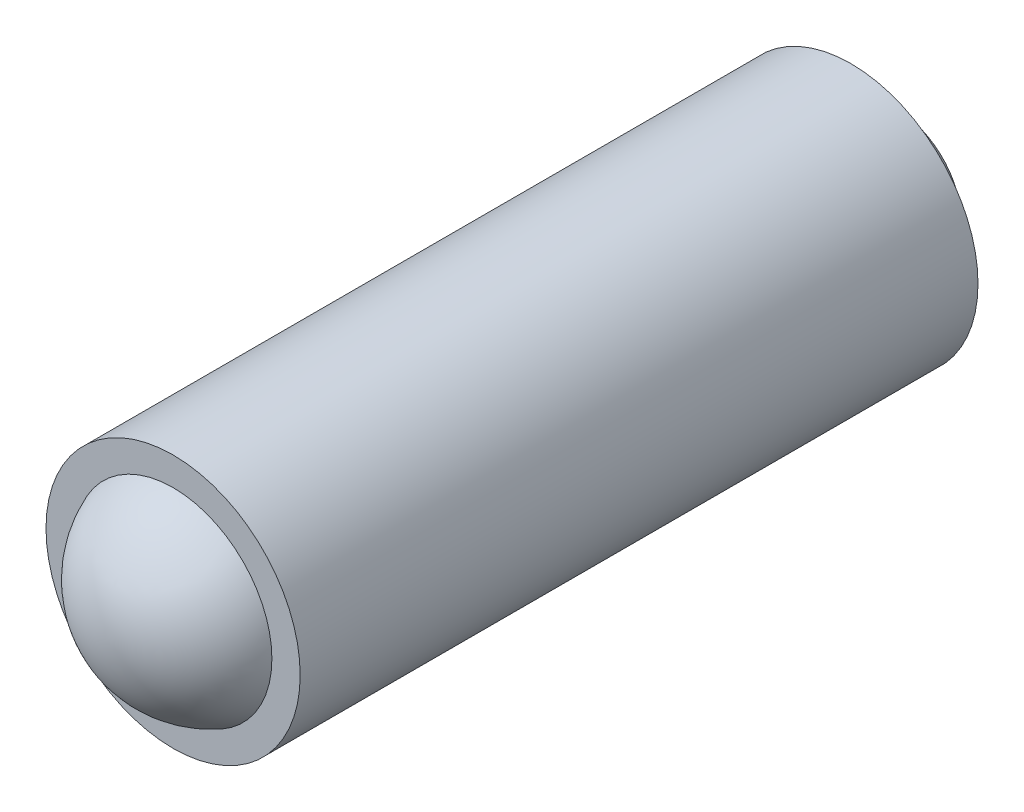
ISO-10303-21;
HEADER;
FILE_DESCRIPTION(('STEP AP214'),'2;1');
FILE_NAME('part.step','',(''),(''),'','','');
FILE_SCHEMA(('AUTOMOTIVE_DESIGN { 1 0 10303 214 1 1 1 1 }'));
ENDSEC;
DATA;
#1=APPLICATION_CONTEXT('core data for automotive mechanical design processes');
#2=APPLICATION_PROTOCOL_DEFINITION('international standard','automotive_design',2000,#1);
#3=PRODUCT_CONTEXT('',#1,'mechanical');
#4=PRODUCT('Part','Part','',(#3));
#5=PRODUCT_RELATED_PRODUCT_CATEGORY('part','',(#4));
#6=PRODUCT_DEFINITION_FORMATION('','',#4);
#7=PRODUCT_DEFINITION_CONTEXT('part definition',#1,'design');
#8=PRODUCT_DEFINITION('design','',#6,#7);
#9=PRODUCT_DEFINITION_SHAPE('','',#8);
#10=(LENGTH_UNIT() NAMED_UNIT(*) SI_UNIT(.MILLI.,.METRE.));
#11=(NAMED_UNIT(*) PLANE_ANGLE_UNIT() SI_UNIT($,.RADIAN.));
#12=(NAMED_UNIT(*) SI_UNIT($,.STERADIAN.) SOLID_ANGLE_UNIT());
#13=UNCERTAINTY_MEASURE_WITH_UNIT(LENGTH_MEASURE(1.E-05),#10,'distance_accuracy_value','');
#14=(GEOMETRIC_REPRESENTATION_CONTEXT(3) GLOBAL_UNCERTAINTY_ASSIGNED_CONTEXT((#13)) GLOBAL_UNIT_ASSIGNED_CONTEXT((#10,
#11,#12)) REPRESENTATION_CONTEXT('',''));
#15=CARTESIAN_POINT('',(0.,0.,0.));
#16=DIRECTION('',(0.,0.,1.));
#17=DIRECTION('',(1.,0.,0.));
#18=AXIS2_PLACEMENT_3D('',#15,#16,#17);
#19=CARTESIAN_POINT('',(0.,0.,-7.1));
#20=DIRECTION('',(0.,0.,1.));
#21=DIRECTION('',(0.,-1.,0.));
#22=AXIS2_PLACEMENT_3D('',#19,#20,#21);
#23=SPHERICAL_SURFACE('',#22,2.5);
#24=CARTESIAN_POINT('',(0.,0.,-8.));
#25=DIRECTION('',(0.,0.,1.));
#26=DIRECTION('',(1.,0.,0.));
#27=AXIS2_PLACEMENT_3D('',#24,#25,#26);
#28=CIRCLE('',#27,2.33238075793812);
#29=CARTESIAN_POINT('',(2.33238075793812,0.,-8.));
#30=VERTEX_POINT('',#29);
#31=EDGE_CURVE('E26',#30,#30,#28,.T.);
#32=ORIENTED_EDGE('',*,*,#31,.F.);
#33=EDGE_LOOP('',(#32));
#34=FACE_BOUND('',#33,.T.);
#35=ADVANCED_FACE('F12',(#34),#23,.T.);
#36=CARTESIAN_POINT('',(0.,0.,7.1));
#37=DIRECTION('',(0.,0.,1.));
#38=DIRECTION('',(0.,1.,0.));
#39=AXIS2_PLACEMENT_3D('',#36,#37,#38);
#40=SPHERICAL_SURFACE('',#39,2.5);
#41=CARTESIAN_POINT('',(0.,0.,8.));
#42=DIRECTION('',(0.,0.,1.));
#43=DIRECTION('',(1.,0.,0.));
#44=AXIS2_PLACEMENT_3D('',#41,#42,#43);
#45=CIRCLE('',#44,2.33238075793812);
#46=CARTESIAN_POINT('',(2.33238075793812,0.,8.));
#47=VERTEX_POINT('',#46);
#48=EDGE_CURVE('E8',#47,#47,#45,.T.);
#49=ORIENTED_EDGE('',*,*,#48,.T.);
#50=EDGE_LOOP('',(#49));
#51=FACE_BOUND('',#50,.T.);
#52=ADVANCED_FACE('F36',(#51),#40,.T.);
#53=CARTESIAN_POINT('',(0.,-2.33238075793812,8.));
#54=DIRECTION('',(0.,0.,1.));
#55=DIRECTION('',(1.,0.,0.));
#56=AXIS2_PLACEMENT_3D('',#53,#54,#55);
#57=PLANE('',#56);
#58=CARTESIAN_POINT('',(0.,0.,8.));
#59=DIRECTION('',(0.,0.,1.));
#60=DIRECTION('',(1.,0.,0.));
#61=AXIS2_PLACEMENT_3D('',#58,#59,#60);
#62=CIRCLE('',#61,3.);
#63=CARTESIAN_POINT('',(3.,0.,8.));
#64=VERTEX_POINT('',#63);
#65=EDGE_CURVE('E18',#64,#64,#62,.T.);
#66=ORIENTED_EDGE('',*,*,#65,.T.);
#67=EDGE_LOOP('',(#66));
#68=FACE_BOUND('',#67,.T.);
#69=ORIENTED_EDGE('',*,*,#48,.F.);
#70=EDGE_LOOP('',(#69));
#71=FACE_BOUND('',#70,.T.);
#72=ADVANCED_FACE('F42',(#68,#71),#57,.T.);
#73=CARTESIAN_POINT('',(0.,0.,7.56311397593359));
#74=DIRECTION('',(0.,0.,1.));
#75=DIRECTION('',(1.,0.,0.));
#76=AXIS2_PLACEMENT_3D('',#73,#74,#75);
#77=CYLINDRICAL_SURFACE('',#76,3.);
#78=CARTESIAN_POINT('',(0.,0.,-8.));
#79=DIRECTION('',(0.,0.,1.));
#80=DIRECTION('',(1.,0.,0.));
#81=AXIS2_PLACEMENT_3D('',#78,#79,#80);
#82=CIRCLE('',#81,3.);
#83=CARTESIAN_POINT('',(3.,0.,-8.));
#84=VERTEX_POINT('',#83);
#85=EDGE_CURVE('E22',#84,#84,#82,.T.);
#86=ORIENTED_EDGE('',*,*,#85,.T.);
#87=EDGE_LOOP('',(#86));
#88=FACE_BOUND('',#87,.T.);
#89=ORIENTED_EDGE('',*,*,#65,.F.);
#90=EDGE_LOOP('',(#89));
#91=FACE_BOUND('',#90,.T.);
#92=ADVANCED_FACE('F47',(#88,#91),#77,.T.);
#93=CARTESIAN_POINT('',(0.,-2.33238075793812,-8.));
#94=DIRECTION('',(0.,0.,-1.));
#95=DIRECTION('',(-1.,0.,0.));
#96=AXIS2_PLACEMENT_3D('',#93,#94,#95);
#97=PLANE('',#96);
#98=ORIENTED_EDGE('',*,*,#31,.T.);
#99=EDGE_LOOP('',(#98));
#100=FACE_BOUND('',#99,.T.);
#101=ORIENTED_EDGE('',*,*,#85,.F.);
#102=EDGE_LOOP('',(#101));
#103=FACE_BOUND('',#102,.T.);
#104=ADVANCED_FACE('F32',(#100,#103),#97,.T.);
#105=CLOSED_SHELL('',(#35,#52,#72,#92,#104));
#106=MANIFOLD_SOLID_BREP('B1',#105);
#107=ADVANCED_BREP_SHAPE_REPRESENTATION('',(#18,#106),#14);
#108=SHAPE_DEFINITION_REPRESENTATION(#9,#107);
ENDSEC;
END-ISO-10303-21;
